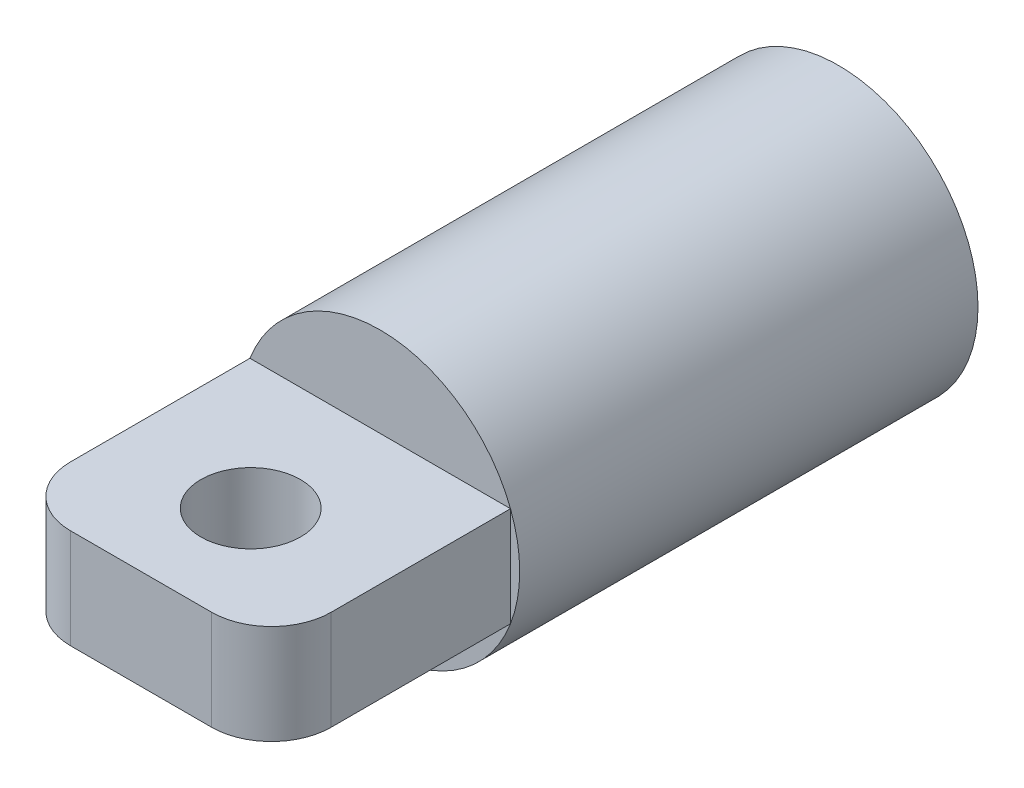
from build123d import *

# Parameters (mm, degrees)
SKETCH1_R           = 7
BOSS_EXTRUDE1_DEPTH = 35
SKETCH2_OUTSIDE_W   = 24.042
SKETCH2_OUTSIDE_H   = 24.042
SKETCH2_OUTSIDE_W_2 = 13.07669683
SKETCH2_OUTSIDE_H_2 = 5
CUT_EXTRUDE1_DEPTH  = 12
FILLET2_R           = 3
SKETCH4_R           = 2.5
CUT_EXTRUDE2_DEPTH  = 8


with BuildPart() as part:
    # Sketch1 → Boss-Extrude1 (new body)
    with BuildSketch(Plane.XY):
        Circle(SKETCH1_R)
    extrude(amount=BOSS_EXTRUDE1_DEPTH)

    # Sketch2 outside → Cut-Extrude1 (cut)
    with BuildSketch(Plane.XY.offset(35)):
        Rectangle(SKETCH2_OUTSIDE_W, SKETCH2_OUTSIDE_H)
        Rectangle(SKETCH2_OUTSIDE_W_2, SKETCH2_OUTSIDE_H_2, mode=Mode.SUBTRACT)
    extrude(amount=-CUT_EXTRUDE1_DEPTH, mode=Mode.SUBTRACT)

    # Fillet2
    fillet2_edges = [part.edges().sort_by_distance(p)[0] for p in [
        (6.538348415, 0, 35),
        (-6.538348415, 0, 35),
    ]]
    fillet(fillet2_edges, radius=FILLET2_R)

    # Sketch4 → Cut-Extrude2 (cut)
    with BuildSketch(Plane.XZ.offset(2.5)):
        with Locations(Location((0, 29.5, 0), (0, 0, 270))):
            Circle(SKETCH4_R)
    extrude(amount=-CUT_EXTRUDE2_DEPTH, mode=Mode.SUBTRACT)


solid = part.part
